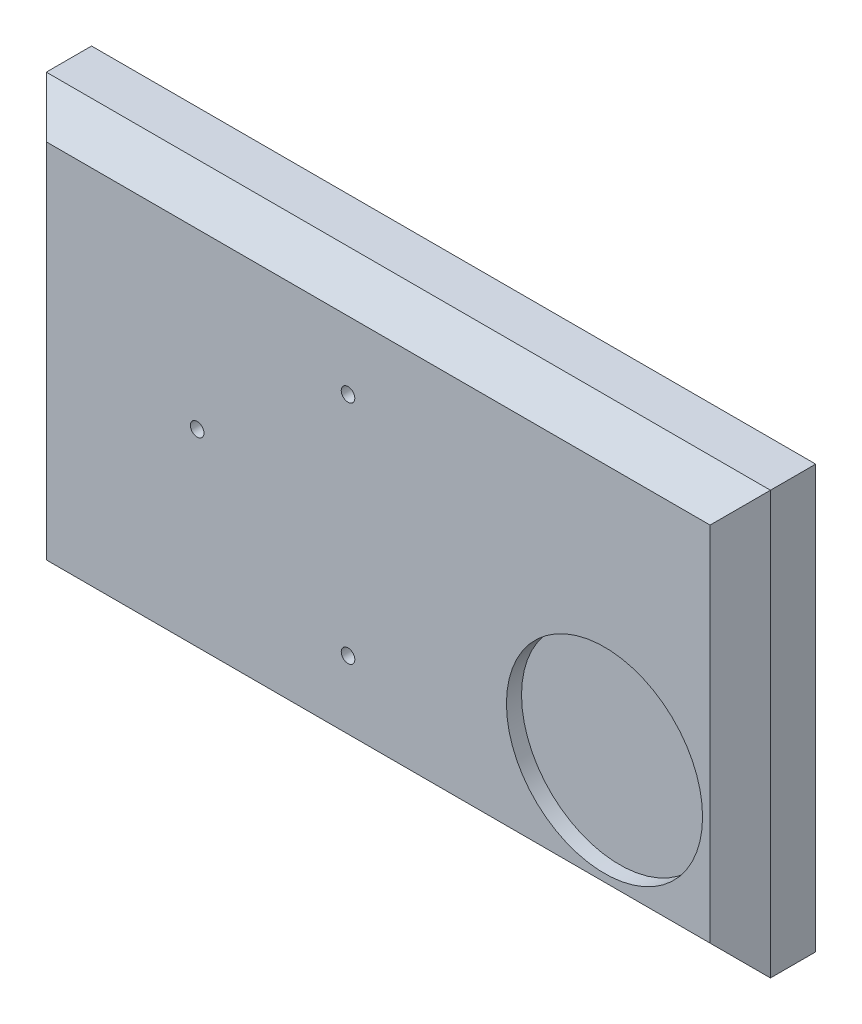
ISO-10303-21;
HEADER;
FILE_DESCRIPTION(('STEP AP214'),'2;1');
FILE_NAME('part.step','',(''),(''),'','','');
FILE_SCHEMA(('AUTOMOTIVE_DESIGN { 1 0 10303 214 1 1 1 1 }'));
ENDSEC;
DATA;
#1=APPLICATION_CONTEXT('core data for automotive mechanical design processes');
#2=APPLICATION_PROTOCOL_DEFINITION('international standard','automotive_design',2000,#1);
#3=PRODUCT_CONTEXT('',#1,'mechanical');
#4=PRODUCT('Part','Part','',(#3));
#5=PRODUCT_RELATED_PRODUCT_CATEGORY('part','',(#4));
#6=PRODUCT_DEFINITION_FORMATION('','',#4);
#7=PRODUCT_DEFINITION_CONTEXT('part definition',#1,'design');
#8=PRODUCT_DEFINITION('design','',#6,#7);
#9=PRODUCT_DEFINITION_SHAPE('','',#8);
#10=(LENGTH_UNIT() NAMED_UNIT(*) SI_UNIT(.MILLI.,.METRE.));
#11=(NAMED_UNIT(*) PLANE_ANGLE_UNIT() SI_UNIT($,.RADIAN.));
#12=(NAMED_UNIT(*) SI_UNIT($,.STERADIAN.) SOLID_ANGLE_UNIT());
#13=UNCERTAINTY_MEASURE_WITH_UNIT(LENGTH_MEASURE(1.E-05),#10,'distance_accuracy_value','');
#14=(GEOMETRIC_REPRESENTATION_CONTEXT(3) GLOBAL_UNCERTAINTY_ASSIGNED_CONTEXT((#13)) GLOBAL_UNIT_ASSIGNED_CONTEXT((#10,
#11,#12)) REPRESENTATION_CONTEXT('',''));
#15=CARTESIAN_POINT('',(0.,0.,0.));
#16=DIRECTION('',(0.,0.,1.));
#17=DIRECTION('',(1.,0.,0.));
#18=AXIS2_PLACEMENT_3D('',#15,#16,#17);
#19=CARTESIAN_POINT('',(120.,70.,25.));
#20=DIRECTION('',(-1.,0.,0.));
#21=DIRECTION('',(0.,-1.,0.));
#22=AXIS2_PLACEMENT_3D('',#19,#20,#21);
#23=PLANE('',#22);
#24=DIRECTION('',(0.,0.,-1.));
#25=VECTOR('',#24,1.);
#26=CARTESIAN_POINT('',(120.,70.,25.));
#27=LINE('',#26,#25);
#28=CARTESIAN_POINT('',(120.,70.,14.9999999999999));
#29=VERTEX_POINT('',#28);
#30=CARTESIAN_POINT('',(120.,70.,0.));
#31=VERTEX_POINT('',#30);
#32=EDGE_CURVE('E88',#29,#31,#27,.T.);
#33=ORIENTED_EDGE('',*,*,#32,.F.);
#34=DIRECTION('',(0.,-1.,0.));
#35=VECTOR('',#34,1.);
#36=CARTESIAN_POINT('',(120.,-70.,14.9999999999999));
#37=LINE('',#36,#35);
#38=CARTESIAN_POINT('',(120.,-70.,14.9999999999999));
#39=VERTEX_POINT('',#38);
#40=EDGE_CURVE('E133',#29,#39,#37,.T.);
#41=ORIENTED_EDGE('',*,*,#40,.T.);
#42=DIRECTION('',(0.,0.,-1.));
#43=VECTOR('',#42,1.);
#44=CARTESIAN_POINT('',(120.,-70.,25.));
#45=LINE('',#44,#43);
#46=CARTESIAN_POINT('',(120.,-70.,0.));
#47=VERTEX_POINT('',#46);
#48=EDGE_CURVE('E109',#39,#47,#45,.T.);
#49=ORIENTED_EDGE('',*,*,#48,.T.);
#50=DIRECTION('',(0.,1.,0.));
#51=VECTOR('',#50,1.);
#52=CARTESIAN_POINT('',(120.,70.,0.));
#53=LINE('',#52,#51);
#54=EDGE_CURVE('E105',#47,#31,#53,.T.);
#55=ORIENTED_EDGE('',*,*,#54,.T.);
#56=EDGE_LOOP('',(#33,#41,#49,#55));
#57=FACE_BOUND('',#56,.T.);
#58=ADVANCED_FACE('F34',(#57),#23,.F.);
#59=CARTESIAN_POINT('',(-120.,70.,25.));
#60=DIRECTION('',(0.,-1.,0.));
#61=DIRECTION('',(0.,0.,-1.));
#62=AXIS2_PLACEMENT_3D('',#59,#60,#61);
#63=PLANE('',#62);
#64=DIRECTION('',(0.,0.,-1.));
#65=VECTOR('',#64,1.);
#66=CARTESIAN_POINT('',(-120.,70.,25.));
#67=LINE('',#66,#65);
#68=CARTESIAN_POINT('',(-120.,70.,14.9999999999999));
#69=VERTEX_POINT('',#68);
#70=CARTESIAN_POINT('',(-120.,70.,0.));
#71=VERTEX_POINT('',#70);
#72=EDGE_CURVE('E99',#69,#71,#67,.T.);
#73=ORIENTED_EDGE('',*,*,#72,.F.);
#74=DIRECTION('',(1.,0.,0.));
#75=VECTOR('',#74,1.);
#76=CARTESIAN_POINT('',(120.,70.,14.9999999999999));
#77=LINE('',#76,#75);
#78=EDGE_CURVE('E11',#69,#29,#77,.T.);
#79=ORIENTED_EDGE('',*,*,#78,.T.);
#80=ORIENTED_EDGE('',*,*,#32,.T.);
#81=DIRECTION('',(-1.,0.,0.));
#82=VECTOR('',#81,1.);
#83=CARTESIAN_POINT('',(-120.,70.,0.));
#84=LINE('',#83,#82);
#85=EDGE_CURVE('E91',#31,#71,#84,.T.);
#86=ORIENTED_EDGE('',*,*,#85,.T.);
#87=EDGE_LOOP('',(#73,#79,#80,#86));
#88=FACE_BOUND('',#87,.T.);
#89=ADVANCED_FACE('F90',(#88),#63,.F.);
#90=CARTESIAN_POINT('',(-120.,70.,25.));
#91=DIRECTION('',(1.,0.,0.));
#92=DIRECTION('',(0.,1.,0.));
#93=AXIS2_PLACEMENT_3D('',#90,#91,#92);
#94=PLANE('',#93);
#95=DIRECTION('',(0.,0.,-1.));
#96=VECTOR('',#95,1.);
#97=CARTESIAN_POINT('',(-120.,-70.,25.));
#98=LINE('',#97,#96);
#99=CARTESIAN_POINT('',(-120.,-70.,14.9999999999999));
#100=VERTEX_POINT('',#99);
#101=CARTESIAN_POINT('',(-120.,-70.,0.));
#102=VERTEX_POINT('',#101);
#103=EDGE_CURVE('E122',#100,#102,#98,.T.);
#104=ORIENTED_EDGE('',*,*,#103,.F.);
#105=DIRECTION('',(0.,1.,0.));
#106=VECTOR('',#105,1.);
#107=CARTESIAN_POINT('',(-120.,70.,14.9999999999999));
#108=LINE('',#107,#106);
#109=EDGE_CURVE('E43',#100,#69,#108,.T.);
#110=ORIENTED_EDGE('',*,*,#109,.T.);
#111=ORIENTED_EDGE('',*,*,#72,.T.);
#112=DIRECTION('',(0.,-1.,0.));
#113=VECTOR('',#112,1.);
#114=CARTESIAN_POINT('',(-120.,70.,0.));
#115=LINE('',#114,#113);
#116=EDGE_CURVE('E107',#71,#102,#115,.T.);
#117=ORIENTED_EDGE('',*,*,#116,.T.);
#118=EDGE_LOOP('',(#104,#110,#111,#117));
#119=FACE_BOUND('',#118,.T.);
#120=ADVANCED_FACE('F223',(#119),#94,.F.);
#121=CARTESIAN_POINT('',(-120.,-70.,25.));
#122=DIRECTION('',(0.,1.,0.));
#123=DIRECTION('',(0.,0.,1.));
#124=AXIS2_PLACEMENT_3D('',#121,#122,#123);
#125=PLANE('',#124);
#126=ORIENTED_EDGE('',*,*,#48,.F.);
#127=DIRECTION('',(-1.,0.,0.));
#128=VECTOR('',#127,1.);
#129=CARTESIAN_POINT('',(-120.,-70.,14.9999999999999));
#130=LINE('',#129,#128);
#131=EDGE_CURVE('E58',#39,#100,#130,.T.);
#132=ORIENTED_EDGE('',*,*,#131,.T.);
#133=ORIENTED_EDGE('',*,*,#103,.T.);
#134=DIRECTION('',(1.,0.,0.));
#135=VECTOR('',#134,1.);
#136=CARTESIAN_POINT('',(-120.,-70.,0.));
#137=LINE('',#136,#135);
#138=EDGE_CURVE('E119',#102,#47,#137,.T.);
#139=ORIENTED_EDGE('',*,*,#138,.T.);
#140=EDGE_LOOP('',(#126,#132,#133,#139));
#141=FACE_BOUND('',#140,.T.);
#142=ADVANCED_FACE('F213',(#141),#125,.F.);
#143=CARTESIAN_POINT('',(0.,0.,25.));
#144=DIRECTION('',(0.,0.,1.));
#145=DIRECTION('',(1.,0.,0.));
#146=AXIS2_PLACEMENT_3D('',#143,#144,#145);
#147=PLANE('',#146);
#148=CARTESIAN_POINT('',(75.,-25.,25.));
#149=DIRECTION('',(0.,0.,1.));
#150=DIRECTION('',(1.,0.,0.));
#151=AXIS2_PLACEMENT_3D('',#148,#149,#150);
#152=CIRCLE('',#151,32.5);
#153=CARTESIAN_POINT('',(107.5,-25.,25.));
#154=VERTEX_POINT('',#153);
#155=EDGE_CURVE('E160',#154,#154,#152,.T.);
#156=ORIENTED_EDGE('',*,*,#155,.F.);
#157=EDGE_LOOP('',(#156));
#158=FACE_BOUND('',#157,.T.);
#159=DIRECTION('',(1.,0.,0.));
#160=VECTOR('',#159,1.);
#161=CARTESIAN_POINT('',(120.,-60.,25.));
#162=LINE('',#161,#160);
#163=CARTESIAN_POINT('',(-110.,-60.,25.));
#164=VERTEX_POINT('',#163);
#165=CARTESIAN_POINT('',(110.,-60.,25.));
#166=VERTEX_POINT('',#165);
#167=EDGE_CURVE('E128',#164,#166,#162,.T.);
#168=ORIENTED_EDGE('',*,*,#167,.T.);
#169=DIRECTION('',(0.,1.,0.));
#170=VECTOR('',#169,1.);
#171=CARTESIAN_POINT('',(110.,70.,25.));
#172=LINE('',#171,#170);
#173=CARTESIAN_POINT('',(110.,60.,25.));
#174=VERTEX_POINT('',#173);
#175=EDGE_CURVE('E130',#166,#174,#172,.T.);
#176=ORIENTED_EDGE('',*,*,#175,.T.);
#177=DIRECTION('',(-1.,0.,0.));
#178=VECTOR('',#177,1.);
#179=CARTESIAN_POINT('',(-120.,60.,25.));
#180=LINE('',#179,#178);
#181=CARTESIAN_POINT('',(-110.,60.,25.));
#182=VERTEX_POINT('',#181);
#183=EDGE_CURVE('E98',#174,#182,#180,.T.);
#184=ORIENTED_EDGE('',*,*,#183,.T.);
#185=DIRECTION('',(0.,-1.,0.));
#186=VECTOR('',#185,1.);
#187=CARTESIAN_POINT('',(-110.,-70.,25.));
#188=LINE('',#187,#186);
#189=EDGE_CURVE('E126',#182,#164,#188,.T.);
#190=ORIENTED_EDGE('',*,*,#189,.T.);
#191=EDGE_LOOP('',(#168,#176,#184,#190));
#192=FACE_BOUND('',#191,.T.);
#193=CARTESIAN_POINT('',(-9.99999999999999,37.5,25.));
#194=DIRECTION('',(0.,0.,-1.));
#195=DIRECTION('',(-1.,0.,0.));
#196=AXIS2_PLACEMENT_3D('',#193,#194,#195);
#197=CIRCLE('',#196,2.24999999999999);
#198=CARTESIAN_POINT('',(-12.25,37.5,25.));
#199=VERTEX_POINT('',#198);
#200=EDGE_CURVE('E165',#199,#199,#197,.T.);
#201=ORIENTED_EDGE('',*,*,#200,.T.);
#202=EDGE_LOOP('',(#201));
#203=FACE_BOUND('',#202,.T.);
#204=CARTESIAN_POINT('',(-9.99999999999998,-37.5,25.));
#205=DIRECTION('',(0.,0.,-1.));
#206=DIRECTION('',(-1.,0.,0.));
#207=AXIS2_PLACEMENT_3D('',#204,#205,#206);
#208=CIRCLE('',#207,2.24999999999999);
#209=CARTESIAN_POINT('',(-12.25,-37.5,25.));
#210=VERTEX_POINT('',#209);
#211=EDGE_CURVE('E177',#210,#210,#208,.T.);
#212=ORIENTED_EDGE('',*,*,#211,.T.);
#213=EDGE_LOOP('',(#212));
#214=FACE_BOUND('',#213,.T.);
#215=CARTESIAN_POINT('',(-60.,2.49999999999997,25.));
#216=DIRECTION('',(0.,0.,-1.));
#217=DIRECTION('',(-1.,0.,0.));
#218=AXIS2_PLACEMENT_3D('',#215,#216,#217);
#219=CIRCLE('',#218,2.25);
#220=CARTESIAN_POINT('',(-62.25,2.49999999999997,25.));
#221=VERTEX_POINT('',#220);
#222=EDGE_CURVE('E111',#221,#221,#219,.T.);
#223=ORIENTED_EDGE('',*,*,#222,.T.);
#224=EDGE_LOOP('',(#223));
#225=FACE_BOUND('',#224,.T.);
#226=ADVANCED_FACE('F204',(#158,#192,#203,#214,#225),#147,.T.);
#227=CARTESIAN_POINT('',(0.,0.,0.));
#228=DIRECTION('',(0.,0.,1.));
#229=DIRECTION('',(1.,0.,0.));
#230=AXIS2_PLACEMENT_3D('',#227,#228,#229);
#231=PLANE('',#230);
#232=CARTESIAN_POINT('',(-9.99999999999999,37.5,0.));
#233=DIRECTION('',(0.,0.,-1.));
#234=DIRECTION('',(-1.,0.,0.));
#235=AXIS2_PLACEMENT_3D('',#232,#233,#234);
#236=CIRCLE('',#235,3.99999999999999);
#237=CARTESIAN_POINT('',(-14.,37.5,0.));
#238=VERTEX_POINT('',#237);
#239=EDGE_CURVE('E147',#238,#238,#236,.T.);
#240=ORIENTED_EDGE('',*,*,#239,.F.);
#241=EDGE_LOOP('',(#240));
#242=FACE_BOUND('',#241,.T.);
#243=CARTESIAN_POINT('',(-9.99999999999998,-37.5,0.));
#244=DIRECTION('',(0.,0.,-1.));
#245=DIRECTION('',(-1.,0.,0.));
#246=AXIS2_PLACEMENT_3D('',#243,#244,#245);
#247=CIRCLE('',#246,3.99999999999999);
#248=CARTESIAN_POINT('',(-14.,-37.5,0.));
#249=VERTEX_POINT('',#248);
#250=EDGE_CURVE('E168',#249,#249,#247,.T.);
#251=ORIENTED_EDGE('',*,*,#250,.F.);
#252=EDGE_LOOP('',(#251));
#253=FACE_BOUND('',#252,.T.);
#254=CARTESIAN_POINT('',(-60.,2.49999999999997,0.));
#255=DIRECTION('',(0.,0.,-1.));
#256=DIRECTION('',(-1.,0.,0.));
#257=AXIS2_PLACEMENT_3D('',#254,#255,#256);
#258=CIRCLE('',#257,3.99999999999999);
#259=CARTESIAN_POINT('',(-64.,2.49999999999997,0.));
#260=VERTEX_POINT('',#259);
#261=EDGE_CURVE('E180',#260,#260,#258,.T.);
#262=ORIENTED_EDGE('',*,*,#261,.F.);
#263=EDGE_LOOP('',(#262));
#264=FACE_BOUND('',#263,.T.);
#265=ORIENTED_EDGE('',*,*,#54,.F.);
#266=ORIENTED_EDGE('',*,*,#138,.F.);
#267=ORIENTED_EDGE('',*,*,#116,.F.);
#268=ORIENTED_EDGE('',*,*,#85,.F.);
#269=EDGE_LOOP('',(#265,#266,#267,#268));
#270=FACE_BOUND('',#269,.T.);
#271=ADVANCED_FACE('F103',(#242,#253,#264,#270),#231,.F.);
#272=CARTESIAN_POINT('',(-60.,2.49999999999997,0.));
#273=DIRECTION('',(0.,0.,-1.));
#274=DIRECTION('',(-1.,0.,0.));
#275=AXIS2_PLACEMENT_3D('',#272,#273,#274);
#276=CYLINDRICAL_SURFACE('',#275,2.25);
#277=ORIENTED_EDGE('',*,*,#222,.F.);
#278=EDGE_LOOP('',(#277));
#279=FACE_BOUND('',#278,.T.);
#280=CARTESIAN_POINT('',(-60.,2.49999999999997,4.));
#281=DIRECTION('',(0.,0.,-1.));
#282=DIRECTION('',(-1.,0.,0.));
#283=AXIS2_PLACEMENT_3D('',#280,#281,#282);
#284=CIRCLE('',#283,2.25);
#285=CARTESIAN_POINT('',(-62.25,2.49999999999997,4.));
#286=VERTEX_POINT('',#285);
#287=EDGE_CURVE('E114',#286,#286,#284,.T.);
#288=ORIENTED_EDGE('',*,*,#287,.T.);
#289=EDGE_LOOP('',(#288));
#290=FACE_BOUND('',#289,.T.);
#291=ADVANCED_FACE('F188',(#279,#290),#276,.F.);
#292=CARTESIAN_POINT('',(-57.75,2.49999999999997,4.));
#293=DIRECTION('',(0.,0.,1.));
#294=DIRECTION('',(1.,0.,0.));
#295=AXIS2_PLACEMENT_3D('',#292,#293,#294);
#296=PLANE('',#295);
#297=ORIENTED_EDGE('',*,*,#287,.F.);
#298=EDGE_LOOP('',(#297));
#299=FACE_BOUND('',#298,.T.);
#300=CARTESIAN_POINT('',(-60.,2.49999999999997,4.));
#301=DIRECTION('',(0.,0.,-1.));
#302=DIRECTION('',(-1.,0.,0.));
#303=AXIS2_PLACEMENT_3D('',#300,#301,#302);
#304=CIRCLE('',#303,4.);
#305=CARTESIAN_POINT('',(-64.,2.49999999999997,4.));
#306=VERTEX_POINT('',#305);
#307=EDGE_CURVE('E183',#306,#306,#304,.T.);
#308=ORIENTED_EDGE('',*,*,#307,.T.);
#309=EDGE_LOOP('',(#308));
#310=FACE_BOUND('',#309,.T.);
#311=ADVANCED_FACE('F190',(#299,#310),#296,.F.);
#312=CARTESIAN_POINT('',(-60.,2.49999999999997,0.));
#313=DIRECTION('',(0.,0.,-1.));
#314=DIRECTION('',(-1.,0.,0.));
#315=AXIS2_PLACEMENT_3D('',#312,#313,#314);
#316=CYLINDRICAL_SURFACE('',#315,3.99999999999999);
#317=ORIENTED_EDGE('',*,*,#307,.F.);
#318=EDGE_LOOP('',(#317));
#319=FACE_BOUND('',#318,.T.);
#320=ORIENTED_EDGE('',*,*,#261,.T.);
#321=EDGE_LOOP('',(#320));
#322=FACE_BOUND('',#321,.T.);
#323=ADVANCED_FACE('F193',(#319,#322),#316,.F.);
#324=CARTESIAN_POINT('',(-9.99999999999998,-37.5,0.));
#325=DIRECTION('',(0.,0.,-1.));
#326=DIRECTION('',(-1.,0.,0.));
#327=AXIS2_PLACEMENT_3D('',#324,#325,#326);
#328=CYLINDRICAL_SURFACE('',#327,2.25);
#329=ORIENTED_EDGE('',*,*,#211,.F.);
#330=EDGE_LOOP('',(#329));
#331=FACE_BOUND('',#330,.T.);
#332=CARTESIAN_POINT('',(-9.99999999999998,-37.5,4.));
#333=DIRECTION('',(0.,0.,-1.));
#334=DIRECTION('',(-1.,0.,0.));
#335=AXIS2_PLACEMENT_3D('',#332,#333,#334);
#336=CIRCLE('',#335,2.25);
#337=CARTESIAN_POINT('',(-12.25,-37.5,4.));
#338=VERTEX_POINT('',#337);
#339=EDGE_CURVE('E174',#338,#338,#336,.T.);
#340=ORIENTED_EDGE('',*,*,#339,.T.);
#341=EDGE_LOOP('',(#340));
#342=FACE_BOUND('',#341,.T.);
#343=ADVANCED_FACE('F199',(#331,#342),#328,.F.);
#344=CARTESIAN_POINT('',(-7.74999999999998,-37.5,4.));
#345=DIRECTION('',(0.,0.,1.));
#346=DIRECTION('',(1.,0.,0.));
#347=AXIS2_PLACEMENT_3D('',#344,#345,#346);
#348=PLANE('',#347);
#349=ORIENTED_EDGE('',*,*,#339,.F.);
#350=EDGE_LOOP('',(#349));
#351=FACE_BOUND('',#350,.T.);
#352=CARTESIAN_POINT('',(-9.99999999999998,-37.5,4.));
#353=DIRECTION('',(0.,0.,-1.));
#354=DIRECTION('',(-1.,0.,0.));
#355=AXIS2_PLACEMENT_3D('',#352,#353,#354);
#356=CIRCLE('',#355,4.);
#357=CARTESIAN_POINT('',(-14.,-37.5,4.));
#358=VERTEX_POINT('',#357);
#359=EDGE_CURVE('E171',#358,#358,#356,.T.);
#360=ORIENTED_EDGE('',*,*,#359,.T.);
#361=EDGE_LOOP('',(#360));
#362=FACE_BOUND('',#361,.T.);
#363=ADVANCED_FACE('F301',(#351,#362),#348,.F.);
#364=CARTESIAN_POINT('',(-9.99999999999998,-37.5,0.));
#365=DIRECTION('',(0.,0.,-1.));
#366=DIRECTION('',(-1.,0.,0.));
#367=AXIS2_PLACEMENT_3D('',#364,#365,#366);
#368=CYLINDRICAL_SURFACE('',#367,3.99999999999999);
#369=ORIENTED_EDGE('',*,*,#359,.F.);
#370=EDGE_LOOP('',(#369));
#371=FACE_BOUND('',#370,.T.);
#372=ORIENTED_EDGE('',*,*,#250,.T.);
#373=EDGE_LOOP('',(#372));
#374=FACE_BOUND('',#373,.T.);
#375=ADVANCED_FACE('F297',(#371,#374),#368,.F.);
#376=CARTESIAN_POINT('',(-9.99999999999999,37.5,0.));
#377=DIRECTION('',(0.,0.,-1.));
#378=DIRECTION('',(-1.,0.,0.));
#379=AXIS2_PLACEMENT_3D('',#376,#377,#378);
#380=CYLINDRICAL_SURFACE('',#379,2.25);
#381=ORIENTED_EDGE('',*,*,#200,.F.);
#382=EDGE_LOOP('',(#381));
#383=FACE_BOUND('',#382,.T.);
#384=CARTESIAN_POINT('',(-9.99999999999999,37.5,4.));
#385=DIRECTION('',(0.,0.,-1.));
#386=DIRECTION('',(-1.,0.,0.));
#387=AXIS2_PLACEMENT_3D('',#384,#385,#386);
#388=CIRCLE('',#387,2.25);
#389=CARTESIAN_POINT('',(-12.25,37.5,4.));
#390=VERTEX_POINT('',#389);
#391=EDGE_CURVE('E157',#390,#390,#388,.T.);
#392=ORIENTED_EDGE('',*,*,#391,.T.);
#393=EDGE_LOOP('',(#392));
#394=FACE_BOUND('',#393,.T.);
#395=ADVANCED_FACE('F293',(#383,#394),#380,.F.);
#396=CARTESIAN_POINT('',(-7.74999999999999,37.5,4.));
#397=DIRECTION('',(0.,0.,1.));
#398=DIRECTION('',(1.,0.,0.));
#399=AXIS2_PLACEMENT_3D('',#396,#397,#398);
#400=PLANE('',#399);
#401=ORIENTED_EDGE('',*,*,#391,.F.);
#402=EDGE_LOOP('',(#401));
#403=FACE_BOUND('',#402,.T.);
#404=CARTESIAN_POINT('',(-9.99999999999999,37.5,4.));
#405=DIRECTION('',(0.,0.,-1.));
#406=DIRECTION('',(-1.,0.,0.));
#407=AXIS2_PLACEMENT_3D('',#404,#405,#406);
#408=CIRCLE('',#407,4.);
#409=CARTESIAN_POINT('',(-14.,37.5,4.));
#410=VERTEX_POINT('',#409);
#411=EDGE_CURVE('E152',#410,#410,#408,.T.);
#412=ORIENTED_EDGE('',*,*,#411,.T.);
#413=EDGE_LOOP('',(#412));
#414=FACE_BOUND('',#413,.T.);
#415=ADVANCED_FACE('F244',(#403,#414),#400,.F.);
#416=CARTESIAN_POINT('',(-9.99999999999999,37.5,0.));
#417=DIRECTION('',(0.,0.,-1.));
#418=DIRECTION('',(-1.,0.,0.));
#419=AXIS2_PLACEMENT_3D('',#416,#417,#418);
#420=CYLINDRICAL_SURFACE('',#419,3.99999999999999);
#421=ORIENTED_EDGE('',*,*,#411,.F.);
#422=EDGE_LOOP('',(#421));
#423=FACE_BOUND('',#422,.T.);
#424=ORIENTED_EDGE('',*,*,#239,.T.);
#425=EDGE_LOOP('',(#424));
#426=FACE_BOUND('',#425,.T.);
#427=ADVANCED_FACE('F239',(#423,#426),#420,.F.);
#428=CARTESIAN_POINT('',(-110.,0.,25.));
#429=DIRECTION('',(-0.70710678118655,0.,0.707106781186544));
#430=DIRECTION('',(0.,1.,0.));
#431=AXIS2_PLACEMENT_3D('',#428,#429,#430);
#432=PLANE('',#431);
#433=DIRECTION('',(0.577350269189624,-0.577350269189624,0.577350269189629));
#434=VECTOR('',#433,1.);
#435=CARTESIAN_POINT('',(-73.3333333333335,23.3333333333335,61.6666666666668));
#436=LINE('',#435,#434);
#437=EDGE_CURVE('E141',#69,#182,#436,.T.);
#438=ORIENTED_EDGE('',*,*,#437,.F.);
#439=ORIENTED_EDGE('',*,*,#109,.F.);
#440=DIRECTION('',(0.577350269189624,0.577350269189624,0.577350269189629));
#441=VECTOR('',#440,1.);
#442=CARTESIAN_POINT('',(-90.0000000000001,-40.0000000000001,45.));
#443=LINE('',#442,#441);
#444=EDGE_CURVE('E38',#164,#100,#443,.F.);
#445=ORIENTED_EDGE('',*,*,#444,.F.);
#446=ORIENTED_EDGE('',*,*,#189,.F.);
#447=EDGE_LOOP('',(#438,#439,#445,#446));
#448=FACE_BOUND('',#447,.T.);
#449=ADVANCED_FACE('F36',(#448),#432,.T.);
#450=CARTESIAN_POINT('',(0.,-60.,25.));
#451=DIRECTION('',(0.,-0.70710678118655,0.707106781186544));
#452=DIRECTION('',(-1.,0.,0.));
#453=AXIS2_PLACEMENT_3D('',#450,#451,#452);
#454=PLANE('',#453);
#455=ORIENTED_EDGE('',*,*,#444,.T.);
#456=ORIENTED_EDGE('',*,*,#131,.F.);
#457=DIRECTION('',(-0.577350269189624,0.577350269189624,0.577350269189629));
#458=VECTOR('',#457,1.);
#459=CARTESIAN_POINT('',(73.3333333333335,-23.3333333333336,61.6666666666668));
#460=LINE('',#459,#458);
#461=EDGE_CURVE('E139',#166,#39,#460,.F.);
#462=ORIENTED_EDGE('',*,*,#461,.F.);
#463=ORIENTED_EDGE('',*,*,#167,.F.);
#464=EDGE_LOOP('',(#455,#456,#462,#463));
#465=FACE_BOUND('',#464,.T.);
#466=ADVANCED_FACE('F234',(#465),#454,.T.);
#467=CARTESIAN_POINT('',(0.,60.,25.));
#468=DIRECTION('',(0.,0.70710678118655,0.707106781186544));
#469=DIRECTION('',(1.,0.,0.));
#470=AXIS2_PLACEMENT_3D('',#467,#468,#469);
#471=PLANE('',#470);
#472=ORIENTED_EDGE('',*,*,#437,.T.);
#473=ORIENTED_EDGE('',*,*,#183,.F.);
#474=DIRECTION('',(0.577350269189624,0.577350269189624,-0.577350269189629));
#475=VECTOR('',#474,1.);
#476=CARTESIAN_POINT('',(73.3333333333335,23.3333333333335,61.6666666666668));
#477=LINE('',#476,#475);
#478=EDGE_CURVE('E137',#29,#174,#477,.F.);
#479=ORIENTED_EDGE('',*,*,#478,.F.);
#480=ORIENTED_EDGE('',*,*,#78,.F.);
#481=EDGE_LOOP('',(#472,#473,#479,#480));
#482=FACE_BOUND('',#481,.T.);
#483=ADVANCED_FACE('F231',(#482),#471,.T.);
#484=CARTESIAN_POINT('',(110.,0.,25.));
#485=DIRECTION('',(0.70710678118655,0.,0.707106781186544));
#486=DIRECTION('',(0.,-1.,0.));
#487=AXIS2_PLACEMENT_3D('',#484,#485,#486);
#488=PLANE('',#487);
#489=ORIENTED_EDGE('',*,*,#461,.T.);
#490=ORIENTED_EDGE('',*,*,#40,.F.);
#491=ORIENTED_EDGE('',*,*,#478,.T.);
#492=ORIENTED_EDGE('',*,*,#175,.F.);
#493=EDGE_LOOP('',(#489,#490,#491,#492));
#494=FACE_BOUND('',#493,.T.);
#495=ADVANCED_FACE('F227',(#494),#488,.T.);
#496=CARTESIAN_POINT('',(75.,-25.,20.));
#497=DIRECTION('',(0.,0.,1.));
#498=DIRECTION('',(1.,0.,0.));
#499=AXIS2_PLACEMENT_3D('',#496,#497,#498);
#500=CYLINDRICAL_SURFACE('',#499,32.5);
#501=CARTESIAN_POINT('',(75.,-25.,20.));
#502=DIRECTION('',(0.,0.,1.));
#503=DIRECTION('',(1.,0.,0.));
#504=AXIS2_PLACEMENT_3D('',#501,#502,#503);
#505=CIRCLE('',#504,32.5);
#506=CARTESIAN_POINT('',(107.5,-25.,20.));
#507=VERTEX_POINT('',#506);
#508=EDGE_CURVE('E140',#507,#507,#505,.T.);
#509=ORIENTED_EDGE('',*,*,#508,.F.);
#510=EDGE_LOOP('',(#509));
#511=FACE_BOUND('',#510,.T.);
#512=ORIENTED_EDGE('',*,*,#155,.T.);
#513=EDGE_LOOP('',(#512));
#514=FACE_BOUND('',#513,.T.);
#515=ADVANCED_FACE('F230',(#511,#514),#500,.F.);
#516=CARTESIAN_POINT('',(75.,-25.,20.));
#517=DIRECTION('',(0.,0.,1.));
#518=DIRECTION('',(1.,0.,0.));
#519=AXIS2_PLACEMENT_3D('',#516,#517,#518);
#520=PLANE('',#519);
#521=ORIENTED_EDGE('',*,*,#508,.T.);
#522=EDGE_LOOP('',(#521));
#523=FACE_BOUND('',#522,.T.);
#524=ADVANCED_FACE('F275',(#523),#520,.T.);
#525=CLOSED_SHELL('',(#58,#89,#120,#142,#226,#271,#291,#311,#323,#343,#363,#375,#395,#415,#427,
#449,#466,#483,#495,#515,#524));
#526=MANIFOLD_SOLID_BREP('B2',#525);
#527=ADVANCED_BREP_SHAPE_REPRESENTATION('',(#18,#526),#14);
#528=SHAPE_DEFINITION_REPRESENTATION(#9,#527);
ENDSEC;
END-ISO-10303-21;
